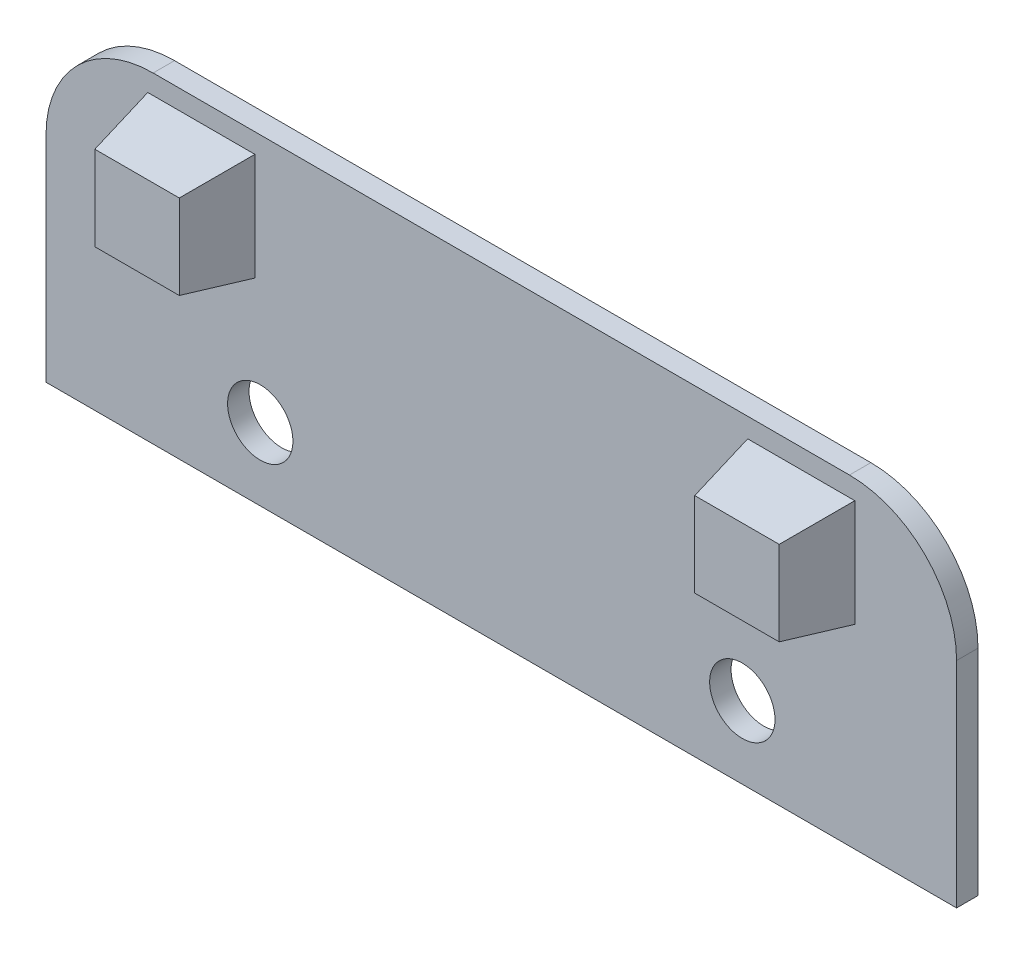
ISO-10303-21;
HEADER;
FILE_DESCRIPTION(('STEP AP214'),'2;1');
FILE_NAME('part.step','',(''),(''),'','','');
FILE_SCHEMA(('AUTOMOTIVE_DESIGN { 1 0 10303 214 1 1 1 1 }'));
ENDSEC;
DATA;
#1=APPLICATION_CONTEXT('core data for automotive mechanical design processes');
#2=APPLICATION_PROTOCOL_DEFINITION('international standard','automotive_design',2000,#1);
#3=PRODUCT_CONTEXT('',#1,'mechanical');
#4=PRODUCT('Part','Part','',(#3));
#5=PRODUCT_RELATED_PRODUCT_CATEGORY('part','',(#4));
#6=PRODUCT_DEFINITION_FORMATION('','',#4);
#7=PRODUCT_DEFINITION_CONTEXT('part definition',#1,'design');
#8=PRODUCT_DEFINITION('design','',#6,#7);
#9=PRODUCT_DEFINITION_SHAPE('','',#8);
#10=(LENGTH_UNIT() NAMED_UNIT(*) SI_UNIT(.MILLI.,.METRE.));
#11=(NAMED_UNIT(*) PLANE_ANGLE_UNIT() SI_UNIT($,.RADIAN.));
#12=(NAMED_UNIT(*) SI_UNIT($,.STERADIAN.) SOLID_ANGLE_UNIT());
#13=UNCERTAINTY_MEASURE_WITH_UNIT(LENGTH_MEASURE(1.E-05),#10,'distance_accuracy_value','');
#14=(GEOMETRIC_REPRESENTATION_CONTEXT(3) GLOBAL_UNCERTAINTY_ASSIGNED_CONTEXT((#13)) GLOBAL_UNIT_ASSIGNED_CONTEXT((#10,
#11,#12)) REPRESENTATION_CONTEXT('',''));
#15=CARTESIAN_POINT('',(0.,0.,0.));
#16=DIRECTION('',(0.,0.,1.));
#17=DIRECTION('',(1.,0.,0.));
#18=AXIS2_PLACEMENT_3D('',#15,#16,#17);
#19=CARTESIAN_POINT('',(-65.,40.,4.));
#20=DIRECTION('',(0.,0.,-1.));
#21=DIRECTION('',(-1.,0.,0.));
#22=AXIS2_PLACEMENT_3D('',#19,#20,#21);
#23=PLANE('',#22);
#24=DIRECTION('',(1.,0.,0.));
#25=VECTOR('',#24,1.);
#26=CARTESIAN_POINT('',(66.,56.3499999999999,4.));
#27=LINE('',#26,#25);
#28=CARTESIAN_POINT('',(46.,56.3499999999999,4.));
#29=VERTEX_POINT('',#28);
#30=CARTESIAN_POINT('',(66.,56.3499999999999,4.));
#31=VERTEX_POINT('',#30);
#32=EDGE_CURVE('E141',#29,#31,#27,.T.);
#33=ORIENTED_EDGE('',*,*,#32,.T.);
#34=DIRECTION('',(0.,-1.,0.));
#35=VECTOR('',#34,1.);
#36=CARTESIAN_POINT('',(66.,56.3499999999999,4.));
#37=LINE('',#36,#35);
#38=CARTESIAN_POINT('',(66.,36.3499999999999,4.));
#39=VERTEX_POINT('',#38);
#40=EDGE_CURVE('E151',#31,#39,#37,.T.);
#41=ORIENTED_EDGE('',*,*,#40,.T.);
#42=DIRECTION('',(-1.,0.,0.));
#43=VECTOR('',#42,1.);
#44=CARTESIAN_POINT('',(66.,36.3499999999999,4.));
#45=LINE('',#44,#43);
#46=CARTESIAN_POINT('',(46.,36.3499999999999,4.));
#47=VERTEX_POINT('',#46);
#48=EDGE_CURVE('E160',#39,#47,#45,.T.);
#49=ORIENTED_EDGE('',*,*,#48,.T.);
#50=DIRECTION('',(0.,1.,0.));
#51=VECTOR('',#50,1.);
#52=CARTESIAN_POINT('',(46.,56.3499999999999,4.));
#53=LINE('',#52,#51);
#54=EDGE_CURVE('E51',#47,#29,#53,.T.);
#55=ORIENTED_EDGE('',*,*,#54,.T.);
#56=EDGE_LOOP('',(#33,#41,#49,#55));
#57=FACE_BOUND('',#56,.T.);
#58=CARTESIAN_POINT('',(45.,13.5,4.));
#59=DIRECTION('',(0.,0.,1.));
#60=DIRECTION('',(1.,0.,0.));
#61=AXIS2_PLACEMENT_3D('',#58,#59,#60);
#62=CIRCLE('',#61,6.1);
#63=CARTESIAN_POINT('',(51.1,13.5,4.));
#64=VERTEX_POINT('',#63);
#65=EDGE_CURVE('E207',#64,#64,#62,.T.);
#66=ORIENTED_EDGE('',*,*,#65,.F.);
#67=EDGE_LOOP('',(#66));
#68=FACE_BOUND('',#67,.T.);
#69=DIRECTION('',(0.,-1.,0.));
#70=VECTOR('',#69,1.);
#71=CARTESIAN_POINT('',(-85.,0.,4.));
#72=LINE('',#71,#70);
#73=CARTESIAN_POINT('',(-85.,39.9999999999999,4.));
#74=VERTEX_POINT('',#73);
#75=CARTESIAN_POINT('',(-85.,0.,4.));
#76=VERTEX_POINT('',#75);
#77=EDGE_CURVE('E219',#74,#76,#72,.T.);
#78=ORIENTED_EDGE('',*,*,#77,.T.);
#79=DIRECTION('',(1.,0.,0.));
#80=VECTOR('',#79,1.);
#81=CARTESIAN_POINT('',(-85.,0.,4.));
#82=LINE('',#81,#80);
#83=CARTESIAN_POINT('',(85.,0.,4.));
#84=VERTEX_POINT('',#83);
#85=EDGE_CURVE('E222',#76,#84,#82,.T.);
#86=ORIENTED_EDGE('',*,*,#85,.T.);
#87=DIRECTION('',(0.,1.,0.));
#88=VECTOR('',#87,1.);
#89=CARTESIAN_POINT('',(85.,0.,4.));
#90=LINE('',#89,#88);
#91=CARTESIAN_POINT('',(85.,39.9999999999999,4.));
#92=VERTEX_POINT('',#91);
#93=EDGE_CURVE('E225',#84,#92,#90,.T.);
#94=ORIENTED_EDGE('',*,*,#93,.T.);
#95=CARTESIAN_POINT('',(65.,40.,4.));
#96=DIRECTION('',(0.,0.,1.));
#97=DIRECTION('',(-1.,0.,0.));
#98=AXIS2_PLACEMENT_3D('',#95,#96,#97);
#99=CIRCLE('',#98,20.);
#100=CARTESIAN_POINT('',(64.9999999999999,60.,4.));
#101=VERTEX_POINT('',#100);
#102=EDGE_CURVE('E227',#92,#101,#99,.T.);
#103=ORIENTED_EDGE('',*,*,#102,.T.);
#104=DIRECTION('',(-1.,0.,0.));
#105=VECTOR('',#104,1.);
#106=CARTESIAN_POINT('',(-64.9999999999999,60.,4.));
#107=LINE('',#106,#105);
#108=CARTESIAN_POINT('',(-64.9999999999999,60.,4.));
#109=VERTEX_POINT('',#108);
#110=EDGE_CURVE('E229',#101,#109,#107,.T.);
#111=ORIENTED_EDGE('',*,*,#110,.T.);
#112=CARTESIAN_POINT('',(-65.,40.,4.));
#113=DIRECTION('',(0.,0.,1.));
#114=DIRECTION('',(-1.,0.,0.));
#115=AXIS2_PLACEMENT_3D('',#112,#113,#114);
#116=CIRCLE('',#115,20.);
#117=EDGE_CURVE('E231',#109,#74,#116,.T.);
#118=ORIENTED_EDGE('',*,*,#117,.T.);
#119=EDGE_LOOP('',(#78,#86,#94,#103,#111,#118));
#120=FACE_BOUND('',#119,.T.);
#121=CARTESIAN_POINT('',(-45.,13.5,4.));
#122=DIRECTION('',(0.,0.,1.));
#123=DIRECTION('',(1.,0.,0.));
#124=AXIS2_PLACEMENT_3D('',#121,#122,#123);
#125=CIRCLE('',#124,6.1);
#126=CARTESIAN_POINT('',(-38.9,13.5,4.));
#127=VERTEX_POINT('',#126);
#128=EDGE_CURVE('E213',#127,#127,#125,.T.);
#129=ORIENTED_EDGE('',*,*,#128,.F.);
#130=EDGE_LOOP('',(#129));
#131=FACE_BOUND('',#130,.T.);
#132=DIRECTION('',(0.,-1.,0.));
#133=VECTOR('',#132,1.);
#134=CARTESIAN_POINT('',(-66.,56.3499999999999,4.));
#135=LINE('',#134,#133);
#136=CARTESIAN_POINT('',(-66.,56.3499999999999,4.));
#137=VERTEX_POINT('',#136);
#138=CARTESIAN_POINT('',(-66.,36.3499999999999,4.));
#139=VERTEX_POINT('',#138);
#140=EDGE_CURVE('E147',#137,#139,#135,.T.);
#141=ORIENTED_EDGE('',*,*,#140,.F.);
#142=DIRECTION('',(-1.,0.,0.));
#143=VECTOR('',#142,1.);
#144=CARTESIAN_POINT('',(-66.,56.3499999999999,4.));
#145=LINE('',#144,#143);
#146=CARTESIAN_POINT('',(-46.,56.3499999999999,4.));
#147=VERTEX_POINT('',#146);
#148=EDGE_CURVE('E183',#147,#137,#145,.T.);
#149=ORIENTED_EDGE('',*,*,#148,.F.);
#150=DIRECTION('',(0.,1.,0.));
#151=VECTOR('',#150,1.);
#152=CARTESIAN_POINT('',(-46.,56.3499999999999,4.));
#153=LINE('',#152,#151);
#154=CARTESIAN_POINT('',(-46.,36.3499999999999,4.));
#155=VERTEX_POINT('',#154);
#156=EDGE_CURVE('E180',#155,#147,#153,.T.);
#157=ORIENTED_EDGE('',*,*,#156,.F.);
#158=DIRECTION('',(1.,0.,0.));
#159=VECTOR('',#158,1.);
#160=CARTESIAN_POINT('',(-66.,36.3499999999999,4.));
#161=LINE('',#160,#159);
#162=EDGE_CURVE('E59',#139,#155,#161,.T.);
#163=ORIENTED_EDGE('',*,*,#162,.F.);
#164=EDGE_LOOP('',(#141,#149,#157,#163));
#165=FACE_BOUND('',#164,.T.);
#166=ADVANCED_FACE('F36',(#57,#68,#120,#131,#165),#23,.F.);
#167=CARTESIAN_POINT('',(-65.,40.,0.));
#168=DIRECTION('',(0.,0.,-1.));
#169=DIRECTION('',(-1.,0.,0.));
#170=AXIS2_PLACEMENT_3D('',#167,#168,#169);
#171=PLANE('',#170);
#172=CARTESIAN_POINT('',(-45.,13.5,0.));
#173=DIRECTION('',(0.,0.,1.));
#174=DIRECTION('',(1.,0.,0.));
#175=AXIS2_PLACEMENT_3D('',#172,#173,#174);
#176=CIRCLE('',#175,6.1);
#177=CARTESIAN_POINT('',(-38.9,13.5,0.));
#178=VERTEX_POINT('',#177);
#179=EDGE_CURVE('E210',#178,#178,#176,.T.);
#180=ORIENTED_EDGE('',*,*,#179,.T.);
#181=EDGE_LOOP('',(#180));
#182=FACE_BOUND('',#181,.T.);
#183=DIRECTION('',(0.,-1.,0.));
#184=VECTOR('',#183,1.);
#185=CARTESIAN_POINT('',(-85.,0.,0.));
#186=LINE('',#185,#184);
#187=CARTESIAN_POINT('',(-85.,39.9999999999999,0.));
#188=VERTEX_POINT('',#187);
#189=CARTESIAN_POINT('',(-85.,0.,0.));
#190=VERTEX_POINT('',#189);
#191=EDGE_CURVE('E216',#188,#190,#186,.T.);
#192=ORIENTED_EDGE('',*,*,#191,.F.);
#193=CARTESIAN_POINT('',(-65.,40.,0.));
#194=DIRECTION('',(0.,0.,1.));
#195=DIRECTION('',(-1.,0.,0.));
#196=AXIS2_PLACEMENT_3D('',#193,#194,#195);
#197=CIRCLE('',#196,20.);
#198=CARTESIAN_POINT('',(-64.9999999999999,60.,0.));
#199=VERTEX_POINT('',#198);
#200=EDGE_CURVE('E223',#199,#188,#197,.T.);
#201=ORIENTED_EDGE('',*,*,#200,.F.);
#202=DIRECTION('',(-1.,0.,0.));
#203=VECTOR('',#202,1.);
#204=CARTESIAN_POINT('',(-64.9999999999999,60.,0.));
#205=LINE('',#204,#203);
#206=CARTESIAN_POINT('',(64.9999999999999,60.,0.));
#207=VERTEX_POINT('',#206);
#208=EDGE_CURVE('E242',#207,#199,#205,.T.);
#209=ORIENTED_EDGE('',*,*,#208,.F.);
#210=CARTESIAN_POINT('',(65.,40.,0.));
#211=DIRECTION('',(0.,0.,1.));
#212=DIRECTION('',(-1.,0.,0.));
#213=AXIS2_PLACEMENT_3D('',#210,#211,#212);
#214=CIRCLE('',#213,20.);
#215=CARTESIAN_POINT('',(85.,39.9999999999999,0.));
#216=VERTEX_POINT('',#215);
#217=EDGE_CURVE('E240',#216,#207,#214,.T.);
#218=ORIENTED_EDGE('',*,*,#217,.F.);
#219=DIRECTION('',(0.,1.,0.));
#220=VECTOR('',#219,1.);
#221=CARTESIAN_POINT('',(85.,0.,0.));
#222=LINE('',#221,#220);
#223=CARTESIAN_POINT('',(85.,0.,0.));
#224=VERTEX_POINT('',#223);
#225=EDGE_CURVE('E238',#224,#216,#222,.T.);
#226=ORIENTED_EDGE('',*,*,#225,.F.);
#227=DIRECTION('',(1.,0.,0.));
#228=VECTOR('',#227,1.);
#229=CARTESIAN_POINT('',(-85.,0.,0.));
#230=LINE('',#229,#228);
#231=EDGE_CURVE('E236',#190,#224,#230,.T.);
#232=ORIENTED_EDGE('',*,*,#231,.F.);
#233=EDGE_LOOP('',(#192,#201,#209,#218,#226,#232));
#234=FACE_BOUND('',#233,.T.);
#235=CARTESIAN_POINT('',(45.,13.5,0.));
#236=DIRECTION('',(0.,0.,1.));
#237=DIRECTION('',(1.,0.,0.));
#238=AXIS2_PLACEMENT_3D('',#235,#236,#237);
#239=CIRCLE('',#238,6.1);
#240=CARTESIAN_POINT('',(51.1,13.5,0.));
#241=VERTEX_POINT('',#240);
#242=EDGE_CURVE('E189',#241,#241,#239,.T.);
#243=ORIENTED_EDGE('',*,*,#242,.T.);
#244=EDGE_LOOP('',(#243));
#245=FACE_BOUND('',#244,.T.);
#246=ADVANCED_FACE('F266',(#182,#234,#245),#171,.T.);
#247=CARTESIAN_POINT('',(-85.,0.,4.));
#248=DIRECTION('',(1.,0.,0.));
#249=DIRECTION('',(0.,0.,-1.));
#250=AXIS2_PLACEMENT_3D('',#247,#248,#249);
#251=PLANE('',#250);
#252=ORIENTED_EDGE('',*,*,#191,.T.);
#253=DIRECTION('',(0.,0.,-1.));
#254=VECTOR('',#253,1.);
#255=CARTESIAN_POINT('',(-85.,0.,4.));
#256=LINE('',#255,#254);
#257=EDGE_CURVE('E11',#76,#190,#256,.T.);
#258=ORIENTED_EDGE('',*,*,#257,.F.);
#259=ORIENTED_EDGE('',*,*,#77,.F.);
#260=DIRECTION('',(0.,0.,-1.));
#261=VECTOR('',#260,1.);
#262=CARTESIAN_POINT('',(-85.,39.9999999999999,4.));
#263=LINE('',#262,#261);
#264=EDGE_CURVE('E233',#74,#188,#263,.T.);
#265=ORIENTED_EDGE('',*,*,#264,.T.);
#266=EDGE_LOOP('',(#252,#258,#259,#265));
#267=FACE_BOUND('',#266,.T.);
#268=ADVANCED_FACE('F38',(#267),#251,.F.);
#269=CARTESIAN_POINT('',(-85.,0.,4.));
#270=DIRECTION('',(0.,1.,0.));
#271=DIRECTION('',(0.,0.,1.));
#272=AXIS2_PLACEMENT_3D('',#269,#270,#271);
#273=PLANE('',#272);
#274=ORIENTED_EDGE('',*,*,#231,.T.);
#275=DIRECTION('',(0.,0.,-1.));
#276=VECTOR('',#275,1.);
#277=CARTESIAN_POINT('',(85.,0.,4.));
#278=LINE('',#277,#276);
#279=EDGE_CURVE('E44',#84,#224,#278,.T.);
#280=ORIENTED_EDGE('',*,*,#279,.F.);
#281=ORIENTED_EDGE('',*,*,#85,.F.);
#282=ORIENTED_EDGE('',*,*,#257,.T.);
#283=EDGE_LOOP('',(#274,#280,#281,#282));
#284=FACE_BOUND('',#283,.T.);
#285=ADVANCED_FACE('F284',(#284),#273,.F.);
#286=CARTESIAN_POINT('',(85.,0.,4.));
#287=DIRECTION('',(-1.,0.,0.));
#288=DIRECTION('',(0.,0.,1.));
#289=AXIS2_PLACEMENT_3D('',#286,#287,#288);
#290=PLANE('',#289);
#291=ORIENTED_EDGE('',*,*,#225,.T.);
#292=DIRECTION('',(0.,0.,-1.));
#293=VECTOR('',#292,1.);
#294=CARTESIAN_POINT('',(85.,39.9999999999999,4.));
#295=LINE('',#294,#293);
#296=EDGE_CURVE('E253',#92,#216,#295,.T.);
#297=ORIENTED_EDGE('',*,*,#296,.F.);
#298=ORIENTED_EDGE('',*,*,#93,.F.);
#299=ORIENTED_EDGE('',*,*,#279,.T.);
#300=EDGE_LOOP('',(#291,#297,#298,#299));
#301=FACE_BOUND('',#300,.T.);
#302=ADVANCED_FACE('F260',(#301),#290,.F.);
#303=CARTESIAN_POINT('',(65.,40.,4.));
#304=DIRECTION('',(0.,0.,-1.));
#305=DIRECTION('',(-1.,0.,0.));
#306=AXIS2_PLACEMENT_3D('',#303,#304,#305);
#307=CYLINDRICAL_SURFACE('',#306,20.);
#308=ORIENTED_EDGE('',*,*,#217,.T.);
#309=DIRECTION('',(0.,0.,-1.));
#310=VECTOR('',#309,1.);
#311=CARTESIAN_POINT('',(64.9999999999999,60.,4.));
#312=LINE('',#311,#310);
#313=EDGE_CURVE('E250',#101,#207,#312,.T.);
#314=ORIENTED_EDGE('',*,*,#313,.F.);
#315=ORIENTED_EDGE('',*,*,#102,.F.);
#316=ORIENTED_EDGE('',*,*,#296,.T.);
#317=EDGE_LOOP('',(#308,#314,#315,#316));
#318=FACE_BOUND('',#317,.T.);
#319=ADVANCED_FACE('F272',(#318),#307,.T.);
#320=CARTESIAN_POINT('',(-64.9999999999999,60.,4.));
#321=DIRECTION('',(0.,-1.,0.));
#322=DIRECTION('',(0.,0.,-1.));
#323=AXIS2_PLACEMENT_3D('',#320,#321,#322);
#324=PLANE('',#323);
#325=ORIENTED_EDGE('',*,*,#208,.T.);
#326=DIRECTION('',(0.,0.,-1.));
#327=VECTOR('',#326,1.);
#328=CARTESIAN_POINT('',(-64.9999999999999,60.,4.));
#329=LINE('',#328,#327);
#330=EDGE_CURVE('E247',#109,#199,#329,.T.);
#331=ORIENTED_EDGE('',*,*,#330,.F.);
#332=ORIENTED_EDGE('',*,*,#110,.F.);
#333=ORIENTED_EDGE('',*,*,#313,.T.);
#334=EDGE_LOOP('',(#325,#331,#332,#333));
#335=FACE_BOUND('',#334,.T.);
#336=ADVANCED_FACE('F276',(#335),#324,.F.);
#337=CARTESIAN_POINT('',(-65.,40.,4.));
#338=DIRECTION('',(0.,0.,-1.));
#339=DIRECTION('',(-1.,0.,0.));
#340=AXIS2_PLACEMENT_3D('',#337,#338,#339);
#341=CYLINDRICAL_SURFACE('',#340,20.);
#342=ORIENTED_EDGE('',*,*,#200,.T.);
#343=ORIENTED_EDGE('',*,*,#264,.F.);
#344=ORIENTED_EDGE('',*,*,#117,.F.);
#345=ORIENTED_EDGE('',*,*,#330,.T.);
#346=EDGE_LOOP('',(#342,#343,#344,#345));
#347=FACE_BOUND('',#346,.T.);
#348=ADVANCED_FACE('F287',(#347),#341,.T.);
#349=CARTESIAN_POINT('',(-45.,13.5,4.));
#350=DIRECTION('',(0.,0.,-1.));
#351=DIRECTION('',(-1.,0.,0.));
#352=AXIS2_PLACEMENT_3D('',#349,#350,#351);
#353=CYLINDRICAL_SURFACE('',#352,6.1);
#354=ORIENTED_EDGE('',*,*,#128,.T.);
#355=EDGE_LOOP('',(#354));
#356=FACE_BOUND('',#355,.T.);
#357=ORIENTED_EDGE('',*,*,#179,.F.);
#358=EDGE_LOOP('',(#357));
#359=FACE_BOUND('',#358,.T.);
#360=ADVANCED_FACE('F289',(#356,#359),#353,.F.);
#361=CARTESIAN_POINT('',(45.,13.5,4.));
#362=DIRECTION('',(0.,0.,-1.));
#363=DIRECTION('',(-1.,0.,0.));
#364=AXIS2_PLACEMENT_3D('',#361,#362,#363);
#365=CYLINDRICAL_SURFACE('',#364,6.1);
#366=ORIENTED_EDGE('',*,*,#65,.T.);
#367=EDGE_LOOP('',(#366));
#368=FACE_BOUND('',#367,.T.);
#369=ORIENTED_EDGE('',*,*,#242,.F.);
#370=EDGE_LOOP('',(#369));
#371=FACE_BOUND('',#370,.T.);
#372=ADVANCED_FACE('F295',(#368,#371),#365,.F.);
#373=CARTESIAN_POINT('',(-66.,56.3499999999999,4.));
#374=DIRECTION('',(-0.984807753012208,0.,0.173648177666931));
#375=DIRECTION('',(0.173648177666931,0.,0.984807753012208));
#376=AXIS2_PLACEMENT_3D('',#373,#374,#375);
#377=PLANE('',#376);
#378=ORIENTED_EDGE('',*,*,#140,.T.);
#379=DIRECTION('',(-0.171087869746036,-0.171087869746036,-0.970287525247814));
#380=VECTOR('',#379,1.);
#381=CARTESIAN_POINT('',(-66.,36.3499999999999,4.));
#382=LINE('',#381,#380);
#383=CARTESIAN_POINT('',(-63.8840762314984,38.4659237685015,16.));
#384=VERTEX_POINT('',#383);
#385=EDGE_CURVE('E187',#384,#139,#382,.T.);
#386=ORIENTED_EDGE('',*,*,#385,.F.);
#387=DIRECTION('',(0.,1.,0.));
#388=VECTOR('',#387,1.);
#389=CARTESIAN_POINT('',(-63.8840762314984,56.3499999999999,16.));
#390=LINE('',#389,#388);
#391=CARTESIAN_POINT('',(-63.8840762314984,54.2340762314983,16.));
#392=VERTEX_POINT('',#391);
#393=EDGE_CURVE('E186',#392,#384,#390,.F.);
#394=ORIENTED_EDGE('',*,*,#393,.F.);
#395=DIRECTION('',(-0.171087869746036,0.171087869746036,-0.970287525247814));
#396=VECTOR('',#395,1.);
#397=CARTESIAN_POINT('',(-66.,56.3499999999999,4.));
#398=LINE('',#397,#396);
#399=EDGE_CURVE('E191',#392,#137,#398,.T.);
#400=ORIENTED_EDGE('',*,*,#399,.T.);
#401=EDGE_LOOP('',(#378,#386,#394,#400));
#402=FACE_BOUND('',#401,.T.);
#403=ADVANCED_FACE('F309',(#402),#377,.T.);
#404=CARTESIAN_POINT('',(-66.,36.3499999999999,4.));
#405=DIRECTION('',(0.,-0.984807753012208,0.173648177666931));
#406=DIRECTION('',(0.,-0.173648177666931,-0.984807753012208));
#407=AXIS2_PLACEMENT_3D('',#404,#405,#406);
#408=PLANE('',#407);
#409=ORIENTED_EDGE('',*,*,#162,.T.);
#410=DIRECTION('',(0.171087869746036,-0.171087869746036,-0.970287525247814));
#411=VECTOR('',#410,1.);
#412=CARTESIAN_POINT('',(-46.5854211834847,36.9354211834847,7.32008851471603));
#413=LINE('',#412,#411);
#414=CARTESIAN_POINT('',(-48.1159237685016,38.4659237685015,16.));
#415=VERTEX_POINT('',#414);
#416=EDGE_CURVE('E190',#415,#155,#413,.T.);
#417=ORIENTED_EDGE('',*,*,#416,.F.);
#418=DIRECTION('',(-1.,0.,0.));
#419=VECTOR('',#418,1.);
#420=CARTESIAN_POINT('',(-66.,38.4659237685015,16.));
#421=LINE('',#420,#419);
#422=EDGE_CURVE('E202',#384,#415,#421,.F.);
#423=ORIENTED_EDGE('',*,*,#422,.F.);
#424=ORIENTED_EDGE('',*,*,#385,.T.);
#425=EDGE_LOOP('',(#409,#417,#423,#424));
#426=FACE_BOUND('',#425,.T.);
#427=ADVANCED_FACE('F311',(#426),#408,.T.);
#428=CARTESIAN_POINT('',(-46.,56.3499999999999,4.));
#429=DIRECTION('',(0.984807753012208,0.,0.173648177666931));
#430=DIRECTION('',(0.173648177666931,0.,-0.984807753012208));
#431=AXIS2_PLACEMENT_3D('',#428,#429,#430);
#432=PLANE('',#431);
#433=ORIENTED_EDGE('',*,*,#156,.T.);
#434=DIRECTION('',(0.171087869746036,0.171087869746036,-0.970287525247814));
#435=VECTOR('',#434,1.);
#436=CARTESIAN_POINT('',(-46.5854211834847,55.7645788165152,7.32008851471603));
#437=LINE('',#436,#435);
#438=CARTESIAN_POINT('',(-48.1159237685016,54.2340762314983,16.));
#439=VERTEX_POINT('',#438);
#440=EDGE_CURVE('E194',#439,#147,#437,.T.);
#441=ORIENTED_EDGE('',*,*,#440,.F.);
#442=DIRECTION('',(0.,-1.,0.));
#443=VECTOR('',#442,1.);
#444=CARTESIAN_POINT('',(-48.1159237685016,56.3499999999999,16.));
#445=LINE('',#444,#443);
#446=EDGE_CURVE('E204',#415,#439,#445,.F.);
#447=ORIENTED_EDGE('',*,*,#446,.F.);
#448=ORIENTED_EDGE('',*,*,#416,.T.);
#449=EDGE_LOOP('',(#433,#441,#447,#448));
#450=FACE_BOUND('',#449,.T.);
#451=ADVANCED_FACE('F314',(#450),#432,.T.);
#452=CARTESIAN_POINT('',(-66.,56.3499999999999,4.));
#453=DIRECTION('',(0.,0.984807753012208,0.173648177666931));
#454=DIRECTION('',(0.,-0.173648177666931,0.984807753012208));
#455=AXIS2_PLACEMENT_3D('',#452,#453,#454);
#456=PLANE('',#455);
#457=ORIENTED_EDGE('',*,*,#148,.T.);
#458=ORIENTED_EDGE('',*,*,#399,.F.);
#459=DIRECTION('',(1.,0.,0.));
#460=VECTOR('',#459,1.);
#461=CARTESIAN_POINT('',(-66.,54.2340762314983,16.));
#462=LINE('',#461,#460);
#463=EDGE_CURVE('E195',#439,#392,#462,.F.);
#464=ORIENTED_EDGE('',*,*,#463,.F.);
#465=ORIENTED_EDGE('',*,*,#440,.T.);
#466=EDGE_LOOP('',(#457,#458,#464,#465));
#467=FACE_BOUND('',#466,.T.);
#468=ADVANCED_FACE('F318',(#467),#456,.T.);
#469=CARTESIAN_POINT('',(-66.,36.3499999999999,16.));
#470=DIRECTION('',(0.,0.,1.));
#471=DIRECTION('',(1.,0.,0.));
#472=AXIS2_PLACEMENT_3D('',#469,#470,#471);
#473=PLANE('',#472);
#474=ORIENTED_EDGE('',*,*,#393,.T.);
#475=ORIENTED_EDGE('',*,*,#422,.T.);
#476=ORIENTED_EDGE('',*,*,#446,.T.);
#477=ORIENTED_EDGE('',*,*,#463,.T.);
#478=EDGE_LOOP('',(#474,#475,#476,#477));
#479=FACE_BOUND('',#478,.T.);
#480=ADVANCED_FACE('F322',(#479),#473,.T.);
#481=CARTESIAN_POINT('',(66.,56.3499999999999,4.));
#482=DIRECTION('',(0.984807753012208,0.,0.173648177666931));
#483=DIRECTION('',(0.173648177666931,0.,-0.984807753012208));
#484=AXIS2_PLACEMENT_3D('',#481,#482,#483);
#485=PLANE('',#484);
#486=ORIENTED_EDGE('',*,*,#40,.F.);
#487=DIRECTION('',(0.171087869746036,0.171087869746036,-0.970287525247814));
#488=VECTOR('',#487,1.);
#489=CARTESIAN_POINT('',(66.,56.3499999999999,4.));
#490=LINE('',#489,#488);
#491=CARTESIAN_POINT('',(63.8840762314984,54.2340762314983,16.));
#492=VERTEX_POINT('',#491);
#493=EDGE_CURVE('E137',#492,#31,#490,.T.);
#494=ORIENTED_EDGE('',*,*,#493,.F.);
#495=DIRECTION('',(0.,-1.,0.));
#496=VECTOR('',#495,1.);
#497=CARTESIAN_POINT('',(63.8840762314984,56.3499999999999,16.));
#498=LINE('',#497,#496);
#499=CARTESIAN_POINT('',(63.8840762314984,38.4659237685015,16.));
#500=VERTEX_POINT('',#499);
#501=EDGE_CURVE('E163',#492,#500,#498,.T.);
#502=ORIENTED_EDGE('',*,*,#501,.T.);
#503=DIRECTION('',(0.171087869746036,-0.171087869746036,-0.970287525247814));
#504=VECTOR('',#503,1.);
#505=CARTESIAN_POINT('',(65.4145788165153,36.9354211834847,7.32008851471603));
#506=LINE('',#505,#504);
#507=EDGE_CURVE('E153',#500,#39,#506,.T.);
#508=ORIENTED_EDGE('',*,*,#507,.T.);
#509=EDGE_LOOP('',(#486,#494,#502,#508));
#510=FACE_BOUND('',#509,.T.);
#511=ADVANCED_FACE('F152',(#510),#485,.T.);
#512=CARTESIAN_POINT('',(66.,56.3499999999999,4.));
#513=DIRECTION('',(0.,0.984807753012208,0.173648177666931));
#514=DIRECTION('',(0.,-0.173648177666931,0.984807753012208));
#515=AXIS2_PLACEMENT_3D('',#512,#513,#514);
#516=PLANE('',#515);
#517=ORIENTED_EDGE('',*,*,#32,.F.);
#518=DIRECTION('',(-0.171087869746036,0.171087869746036,-0.970287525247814));
#519=VECTOR('',#518,1.);
#520=CARTESIAN_POINT('',(46.,56.3499999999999,4.));
#521=LINE('',#520,#519);
#522=CARTESIAN_POINT('',(48.1159237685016,54.2340762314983,16.));
#523=VERTEX_POINT('',#522);
#524=EDGE_CURVE('E148',#523,#29,#521,.T.);
#525=ORIENTED_EDGE('',*,*,#524,.F.);
#526=DIRECTION('',(1.,0.,0.));
#527=VECTOR('',#526,1.);
#528=CARTESIAN_POINT('',(66.,54.2340762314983,16.));
#529=LINE('',#528,#527);
#530=EDGE_CURVE('E143',#523,#492,#529,.T.);
#531=ORIENTED_EDGE('',*,*,#530,.T.);
#532=ORIENTED_EDGE('',*,*,#493,.T.);
#533=EDGE_LOOP('',(#517,#525,#531,#532));
#534=FACE_BOUND('',#533,.T.);
#535=ADVANCED_FACE('F139',(#534),#516,.T.);
#536=CARTESIAN_POINT('',(46.,56.3499999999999,4.));
#537=DIRECTION('',(-0.984807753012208,0.,0.173648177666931));
#538=DIRECTION('',(0.173648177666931,0.,0.984807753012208));
#539=AXIS2_PLACEMENT_3D('',#536,#537,#538);
#540=PLANE('',#539);
#541=ORIENTED_EDGE('',*,*,#54,.F.);
#542=DIRECTION('',(-0.171087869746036,-0.171087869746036,-0.970287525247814));
#543=VECTOR('',#542,1.);
#544=CARTESIAN_POINT('',(46.5854211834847,36.9354211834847,7.32008851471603));
#545=LINE('',#544,#543);
#546=CARTESIAN_POINT('',(48.1159237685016,38.4659237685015,16.));
#547=VERTEX_POINT('',#546);
#548=EDGE_CURVE('E166',#547,#47,#545,.T.);
#549=ORIENTED_EDGE('',*,*,#548,.F.);
#550=DIRECTION('',(0.,1.,0.));
#551=VECTOR('',#550,1.);
#552=CARTESIAN_POINT('',(48.1159237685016,56.3499999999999,16.));
#553=LINE('',#552,#551);
#554=EDGE_CURVE('E172',#547,#523,#553,.T.);
#555=ORIENTED_EDGE('',*,*,#554,.T.);
#556=ORIENTED_EDGE('',*,*,#524,.T.);
#557=EDGE_LOOP('',(#541,#549,#555,#556));
#558=FACE_BOUND('',#557,.T.);
#559=ADVANCED_FACE('F332',(#558),#540,.T.);
#560=CARTESIAN_POINT('',(66.,36.3499999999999,4.));
#561=DIRECTION('',(0.,-0.984807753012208,0.173648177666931));
#562=DIRECTION('',(0.,-0.173648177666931,-0.984807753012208));
#563=AXIS2_PLACEMENT_3D('',#560,#561,#562);
#564=PLANE('',#563);
#565=ORIENTED_EDGE('',*,*,#48,.F.);
#566=ORIENTED_EDGE('',*,*,#507,.F.);
#567=DIRECTION('',(-1.,0.,0.));
#568=VECTOR('',#567,1.);
#569=CARTESIAN_POINT('',(66.,38.4659237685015,16.));
#570=LINE('',#569,#568);
#571=EDGE_CURVE('E167',#500,#547,#570,.T.);
#572=ORIENTED_EDGE('',*,*,#571,.T.);
#573=ORIENTED_EDGE('',*,*,#548,.T.);
#574=EDGE_LOOP('',(#565,#566,#572,#573));
#575=FACE_BOUND('',#574,.T.);
#576=ADVANCED_FACE('F335',(#575),#564,.T.);
#577=CARTESIAN_POINT('',(66.,36.3499999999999,16.));
#578=DIRECTION('',(0.,0.,1.));
#579=DIRECTION('',(-1.,0.,0.));
#580=AXIS2_PLACEMENT_3D('',#577,#578,#579);
#581=PLANE('',#580);
#582=ORIENTED_EDGE('',*,*,#501,.F.);
#583=ORIENTED_EDGE('',*,*,#530,.F.);
#584=ORIENTED_EDGE('',*,*,#554,.F.);
#585=ORIENTED_EDGE('',*,*,#571,.F.);
#586=EDGE_LOOP('',(#582,#583,#584,#585));
#587=FACE_BOUND('',#586,.T.);
#588=ADVANCED_FACE('F338',(#587),#581,.T.);
#589=CLOSED_SHELL('',(#166,#246,#268,#285,#302,#319,#336,#348,#360,#372,#403,#427,#451,#468,
#480,#511,#535,#559,#576,#588));
#590=MANIFOLD_SOLID_BREP('B2',#589);
#591=ADVANCED_BREP_SHAPE_REPRESENTATION('',(#18,#590),#14);
#592=SHAPE_DEFINITION_REPRESENTATION(#9,#591);
ENDSEC;
END-ISO-10303-21;
